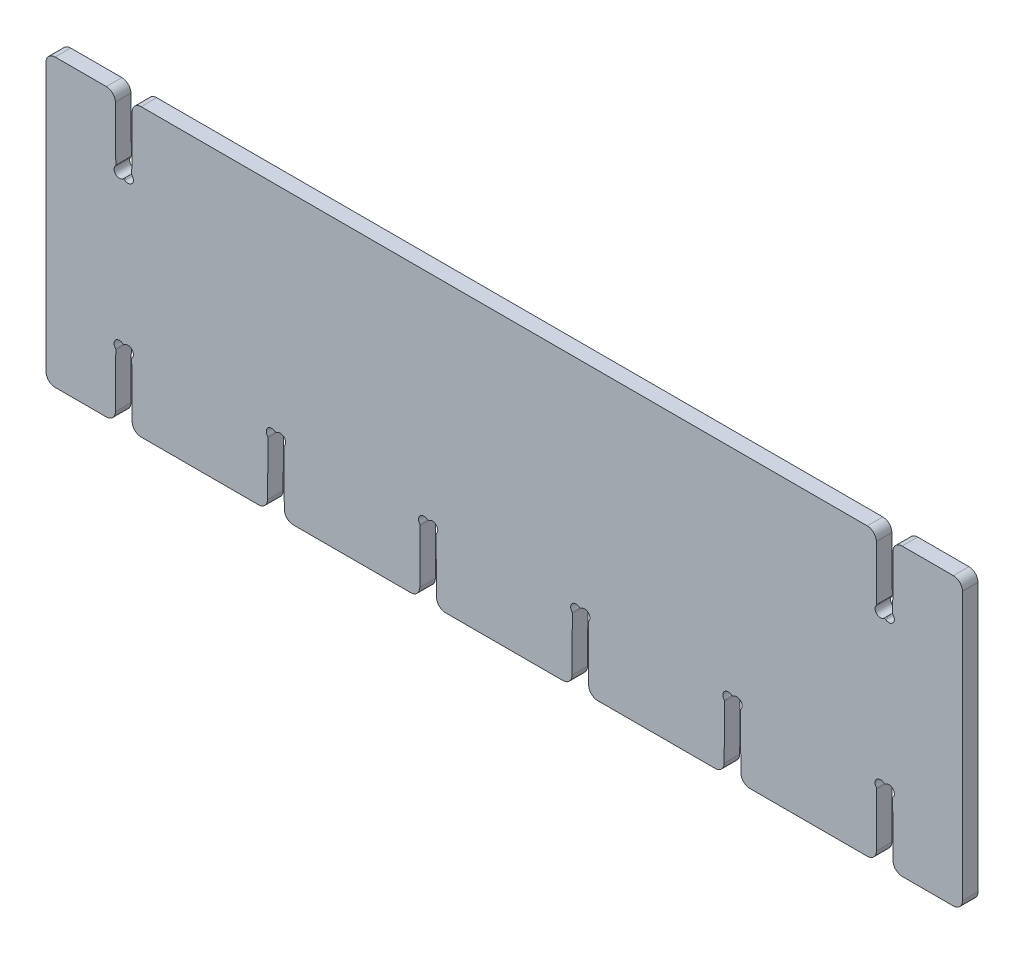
from build123d import *

# Parameters (mm, degrees)
ESQUISSE1_W         = 353.611111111
ESQUISSE1_H         = 220.8
BOSS_EXTRUDE1_DEPTH = 12
CUT_EXTRUDE1_DEPTH  = 418.058098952
LPATTERN1_COUNT     = 3
LPATTERN1_PITCH     = 117.444444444
CONG_1_R            = 7


with BuildPart() as part:
    # Esquisse1 → Boss-Extrude1 (new body)
    with BuildSketch(Plane.XY):
        with Locations((176.805555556, 110.4)):
            Rectangle(ESQUISSE1_W, ESQUISSE1_H)
    extrude(amount=BOSS_EXTRUDE1_DEPTH)

    # Esquisse2 → Cut-Extrude1 (cut, through all)
    with BuildSketch(Plane.XY.offset(12)):
        with BuildLine():
            Line((59.867332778, 55.2), (60.132667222, 55.2))
            ThreePointArc((60.132667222, 55.2), (60.514806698, 55.262472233), (60.857157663, 55.443384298))
            ThreePointArc((60.857157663, 55.443384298), (66.321786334, 54.981041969), (66.438077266, 49.498122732))
            ThreePointArc((66.438077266, 49.498122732), (66.220633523, 49.128471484), (66.147058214, 48.705966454))
            Line((66.147058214, 48.705966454), (66.5, 0))
            Line((66.5, 0), (53.5, 0))
            Line((53.5, 0), (53.852941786, 48.705966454))
            ThreePointArc((53.852941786, 48.705966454), (53.779366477, 49.128471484), (53.561922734, 49.498122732))
            ThreePointArc((53.561922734, 49.498122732), (53.678213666, 54.981041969), (59.142842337, 55.443384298))
            ThreePointArc((59.142842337, 55.443384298), (59.485193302, 55.262472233), (59.867332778, 55.2))
        make_face()
    cut_extrude1 = extrude(amount=-CUT_EXTRUDE1_DEPTH, mode=Mode.SUBTRACT)

    # Mirror1: Cut-Extrude1 across plane
    add(cut_extrude1.mirror(Plane.ZX.offset(110.4)), mode=Mode.SUBTRACT)

    # LPattern1: Cut-Extrude1 ×3
    with Locations(*[(i * LPATTERN1_PITCH, 0, 0) for i in range(1, LPATTERN1_COUNT)]):
        add(cut_extrude1, mode=Mode.SUBTRACT)

    # Cong_1
    cong_1_edges = [part.edges().sort_by_distance(p)[0] for p in [
        (301.388888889, 0, 6),
        (288.388888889, 0, 6),
        (66.5, 0, 6),
        (53.5, 0, 6),
        (53.5, 220.8, 6),
        (66.5, 220.8, 6),
        (0, 220.8, 6),
        (0, 0, 6),
        (183.944444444, 0, 6),
        (170.944444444, 0, 6),
    ]]
    fillet(cong_1_edges, radius=CONG_1_R)

    # Sym_trie1: part across plane


with BuildPart() as part_1:
    add(part.part)
    add(part.part.mirror(Plane(origin=(353.611111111, 0, 12), x_dir=(0, 0, 1), z_dir=(-1, 0, 0))))


solid = part_1.part
